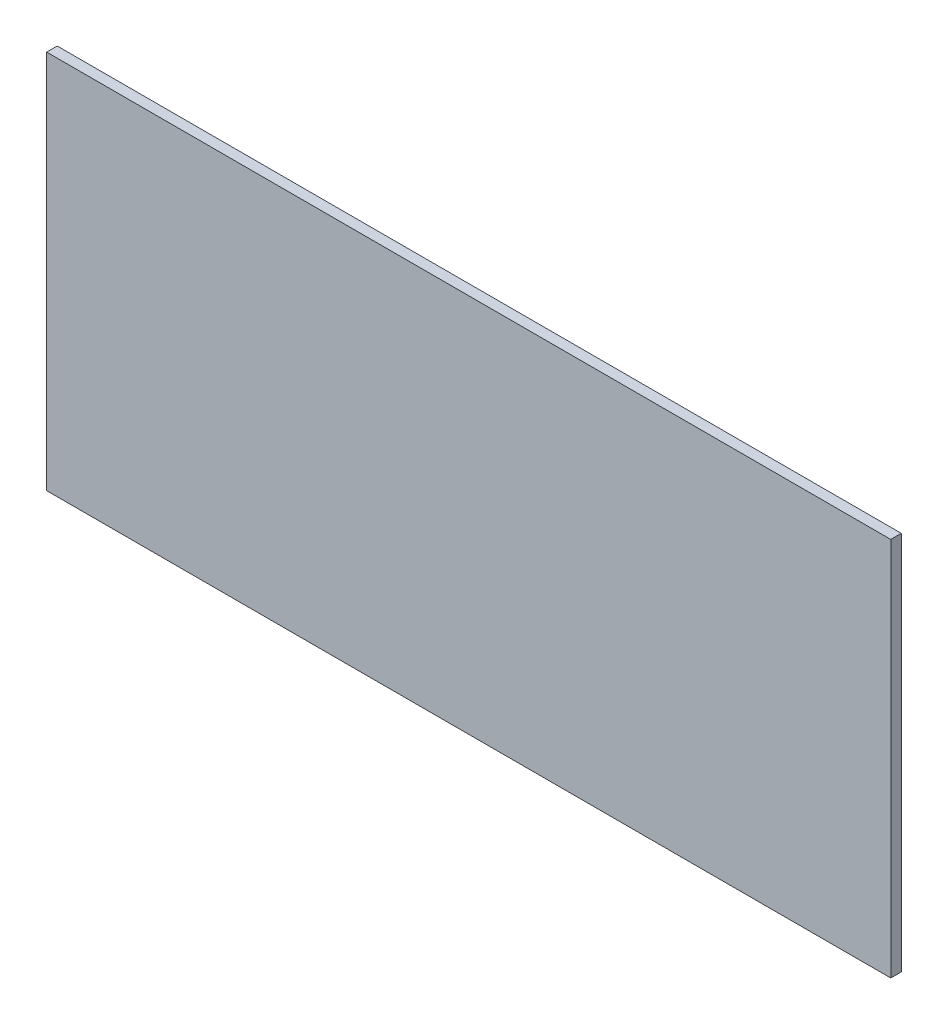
ISO-10303-21;
HEADER;
FILE_DESCRIPTION(('STEP AP214'),'2;1');
FILE_NAME('part.step','',(''),(''),'','','');
FILE_SCHEMA(('AUTOMOTIVE_DESIGN { 1 0 10303 214 1 1 1 1 }'));
ENDSEC;
DATA;
#1=APPLICATION_CONTEXT('core data for automotive mechanical design processes');
#2=APPLICATION_PROTOCOL_DEFINITION('international standard','automotive_design',2000,#1);
#3=PRODUCT_CONTEXT('',#1,'mechanical');
#4=PRODUCT('Part','Part','',(#3));
#5=PRODUCT_RELATED_PRODUCT_CATEGORY('part','',(#4));
#6=PRODUCT_DEFINITION_FORMATION('','',#4);
#7=PRODUCT_DEFINITION_CONTEXT('part definition',#1,'design');
#8=PRODUCT_DEFINITION('design','',#6,#7);
#9=PRODUCT_DEFINITION_SHAPE('','',#8);
#10=(LENGTH_UNIT() NAMED_UNIT(*) SI_UNIT(.MILLI.,.METRE.));
#11=(NAMED_UNIT(*) PLANE_ANGLE_UNIT() SI_UNIT($,.RADIAN.));
#12=(NAMED_UNIT(*) SI_UNIT($,.STERADIAN.) SOLID_ANGLE_UNIT());
#13=UNCERTAINTY_MEASURE_WITH_UNIT(LENGTH_MEASURE(1.E-05),#10,'distance_accuracy_value','');
#14=(GEOMETRIC_REPRESENTATION_CONTEXT(3) GLOBAL_UNCERTAINTY_ASSIGNED_CONTEXT((#13)) GLOBAL_UNIT_ASSIGNED_CONTEXT((#10,
#11,#12)) REPRESENTATION_CONTEXT('',''));
#15=CARTESIAN_POINT('',(0.,0.,0.));
#16=DIRECTION('',(0.,0.,1.));
#17=DIRECTION('',(1.,0.,0.));
#18=AXIS2_PLACEMENT_3D('',#15,#16,#17);
#19=CARTESIAN_POINT('',(0.,0.,3.175));
#20=DIRECTION('',(1.,0.,0.));
#21=DIRECTION('',(0.,0.,-1.));
#22=AXIS2_PLACEMENT_3D('',#19,#20,#21);
#23=PLANE('',#22);
#24=DIRECTION('',(0.,-1.,0.));
#25=VECTOR('',#24,1.);
#26=CARTESIAN_POINT('',(0.,0.,0.));
#27=LINE('',#26,#25);
#28=CARTESIAN_POINT('',(0.,114.3,0.));
#29=VERTEX_POINT('',#28);
#30=CARTESIAN_POINT('',(0.,0.,0.));
#31=VERTEX_POINT('',#30);
#32=EDGE_CURVE('E95',#29,#31,#27,.T.);
#33=ORIENTED_EDGE('',*,*,#32,.T.);
#34=DIRECTION('',(0.,0.,-1.));
#35=VECTOR('',#34,1.);
#36=CARTESIAN_POINT('',(0.,0.,3.175));
#37=LINE('',#36,#35);
#38=CARTESIAN_POINT('',(0.,0.,3.175));
#39=VERTEX_POINT('',#38);
#40=EDGE_CURVE('E11',#39,#31,#37,.T.);
#41=ORIENTED_EDGE('',*,*,#40,.F.);
#42=DIRECTION('',(0.,-1.,0.));
#43=VECTOR('',#42,1.);
#44=CARTESIAN_POINT('',(0.,0.,3.175));
#45=LINE('',#44,#43);
#46=CARTESIAN_POINT('',(0.,114.3,3.175));
#47=VERTEX_POINT('',#46);
#48=EDGE_CURVE('E83',#47,#39,#45,.T.);
#49=ORIENTED_EDGE('',*,*,#48,.F.);
#50=DIRECTION('',(0.,0.,-1.));
#51=VECTOR('',#50,1.);
#52=CARTESIAN_POINT('',(0.,114.3,3.175));
#53=LINE('',#52,#51);
#54=EDGE_CURVE('E91',#47,#29,#53,.T.);
#55=ORIENTED_EDGE('',*,*,#54,.T.);
#56=EDGE_LOOP('',(#33,#41,#49,#55));
#57=FACE_BOUND('',#56,.T.);
#58=ADVANCED_FACE('F32',(#57),#23,.F.);
#59=CARTESIAN_POINT('',(0.,0.,3.175));
#60=DIRECTION('',(0.,1.,0.));
#61=DIRECTION('',(0.,0.,1.));
#62=AXIS2_PLACEMENT_3D('',#59,#60,#61);
#63=PLANE('',#62);
#64=DIRECTION('',(1.,0.,0.));
#65=VECTOR('',#64,1.);
#66=CARTESIAN_POINT('',(0.,0.,0.));
#67=LINE('',#66,#65);
#68=CARTESIAN_POINT('',(254.,0.,0.));
#69=VERTEX_POINT('',#68);
#70=EDGE_CURVE('E87',#31,#69,#67,.T.);
#71=ORIENTED_EDGE('',*,*,#70,.T.);
#72=DIRECTION('',(0.,0.,-1.));
#73=VECTOR('',#72,1.);
#74=CARTESIAN_POINT('',(254.,0.,3.175));
#75=LINE('',#74,#73);
#76=CARTESIAN_POINT('',(254.,0.,3.175));
#77=VERTEX_POINT('',#76);
#78=EDGE_CURVE('E40',#77,#69,#75,.T.);
#79=ORIENTED_EDGE('',*,*,#78,.F.);
#80=DIRECTION('',(1.,0.,0.));
#81=VECTOR('',#80,1.);
#82=CARTESIAN_POINT('',(0.,0.,3.175));
#83=LINE('',#82,#81);
#84=EDGE_CURVE('E78',#39,#77,#83,.T.);
#85=ORIENTED_EDGE('',*,*,#84,.F.);
#86=ORIENTED_EDGE('',*,*,#40,.T.);
#87=EDGE_LOOP('',(#71,#79,#85,#86));
#88=FACE_BOUND('',#87,.T.);
#89=ADVANCED_FACE('F86',(#88),#63,.F.);
#90=CARTESIAN_POINT('',(254.,0.,3.175));
#91=DIRECTION('',(-1.,0.,0.));
#92=DIRECTION('',(0.,0.,1.));
#93=AXIS2_PLACEMENT_3D('',#90,#91,#92);
#94=PLANE('',#93);
#95=DIRECTION('',(0.,1.,0.));
#96=VECTOR('',#95,1.);
#97=CARTESIAN_POINT('',(254.,0.,0.));
#98=LINE('',#97,#96);
#99=CARTESIAN_POINT('',(254.,114.3,0.));
#100=VERTEX_POINT('',#99);
#101=EDGE_CURVE('E65',#69,#100,#98,.T.);
#102=ORIENTED_EDGE('',*,*,#101,.T.);
#103=DIRECTION('',(0.,0.,-1.));
#104=VECTOR('',#103,1.);
#105=CARTESIAN_POINT('',(254.,114.3,3.175));
#106=LINE('',#105,#104);
#107=CARTESIAN_POINT('',(254.,114.3,3.175));
#108=VERTEX_POINT('',#107);
#109=EDGE_CURVE('E88',#108,#100,#106,.T.);
#110=ORIENTED_EDGE('',*,*,#109,.F.);
#111=DIRECTION('',(0.,1.,0.));
#112=VECTOR('',#111,1.);
#113=CARTESIAN_POINT('',(254.,0.,3.175));
#114=LINE('',#113,#112);
#115=EDGE_CURVE('E81',#77,#108,#114,.T.);
#116=ORIENTED_EDGE('',*,*,#115,.F.);
#117=ORIENTED_EDGE('',*,*,#78,.T.);
#118=EDGE_LOOP('',(#102,#110,#116,#117));
#119=FACE_BOUND('',#118,.T.);
#120=ADVANCED_FACE('F89',(#119),#94,.F.);
#121=CARTESIAN_POINT('',(0.,114.3,3.175));
#122=DIRECTION('',(0.,-1.,0.));
#123=DIRECTION('',(0.,0.,-1.));
#124=AXIS2_PLACEMENT_3D('',#121,#122,#123);
#125=PLANE('',#124);
#126=DIRECTION('',(-1.,0.,0.));
#127=VECTOR('',#126,1.);
#128=CARTESIAN_POINT('',(0.,114.3,0.));
#129=LINE('',#128,#127);
#130=EDGE_CURVE('E71',#100,#29,#129,.T.);
#131=ORIENTED_EDGE('',*,*,#130,.T.);
#132=ORIENTED_EDGE('',*,*,#54,.F.);
#133=DIRECTION('',(-1.,0.,0.));
#134=VECTOR('',#133,1.);
#135=CARTESIAN_POINT('',(0.,114.3,3.175));
#136=LINE('',#135,#134);
#137=EDGE_CURVE('E48',#108,#47,#136,.T.);
#138=ORIENTED_EDGE('',*,*,#137,.F.);
#139=ORIENTED_EDGE('',*,*,#109,.T.);
#140=EDGE_LOOP('',(#131,#132,#138,#139));
#141=FACE_BOUND('',#140,.T.);
#142=ADVANCED_FACE('F102',(#141),#125,.F.);
#143=CARTESIAN_POINT('',(0.,0.,3.175));
#144=DIRECTION('',(0.,0.,-1.));
#145=DIRECTION('',(-1.,0.,0.));
#146=AXIS2_PLACEMENT_3D('',#143,#144,#145);
#147=PLANE('',#146);
#148=ORIENTED_EDGE('',*,*,#48,.T.);
#149=ORIENTED_EDGE('',*,*,#84,.T.);
#150=ORIENTED_EDGE('',*,*,#115,.T.);
#151=ORIENTED_EDGE('',*,*,#137,.T.);
#152=EDGE_LOOP('',(#148,#149,#150,#151));
#153=FACE_BOUND('',#152,.T.);
#154=ADVANCED_FACE('F79',(#153),#147,.F.);
#155=CARTESIAN_POINT('',(0.,0.,0.));
#156=DIRECTION('',(0.,0.,-1.));
#157=DIRECTION('',(-1.,0.,0.));
#158=AXIS2_PLACEMENT_3D('',#155,#156,#157);
#159=PLANE('',#158);
#160=ORIENTED_EDGE('',*,*,#32,.F.);
#161=ORIENTED_EDGE('',*,*,#130,.F.);
#162=ORIENTED_EDGE('',*,*,#101,.F.);
#163=ORIENTED_EDGE('',*,*,#70,.F.);
#164=EDGE_LOOP('',(#160,#161,#162,#163));
#165=FACE_BOUND('',#164,.T.);
#166=ADVANCED_FACE('F105',(#165),#159,.T.);
#167=CLOSED_SHELL('',(#58,#89,#120,#142,#154,#166));
#168=MANIFOLD_SOLID_BREP('B2',#167);
#169=ADVANCED_BREP_SHAPE_REPRESENTATION('',(#18,#168),#14);
#170=SHAPE_DEFINITION_REPRESENTATION(#9,#169);
ENDSEC;
END-ISO-10303-21;
